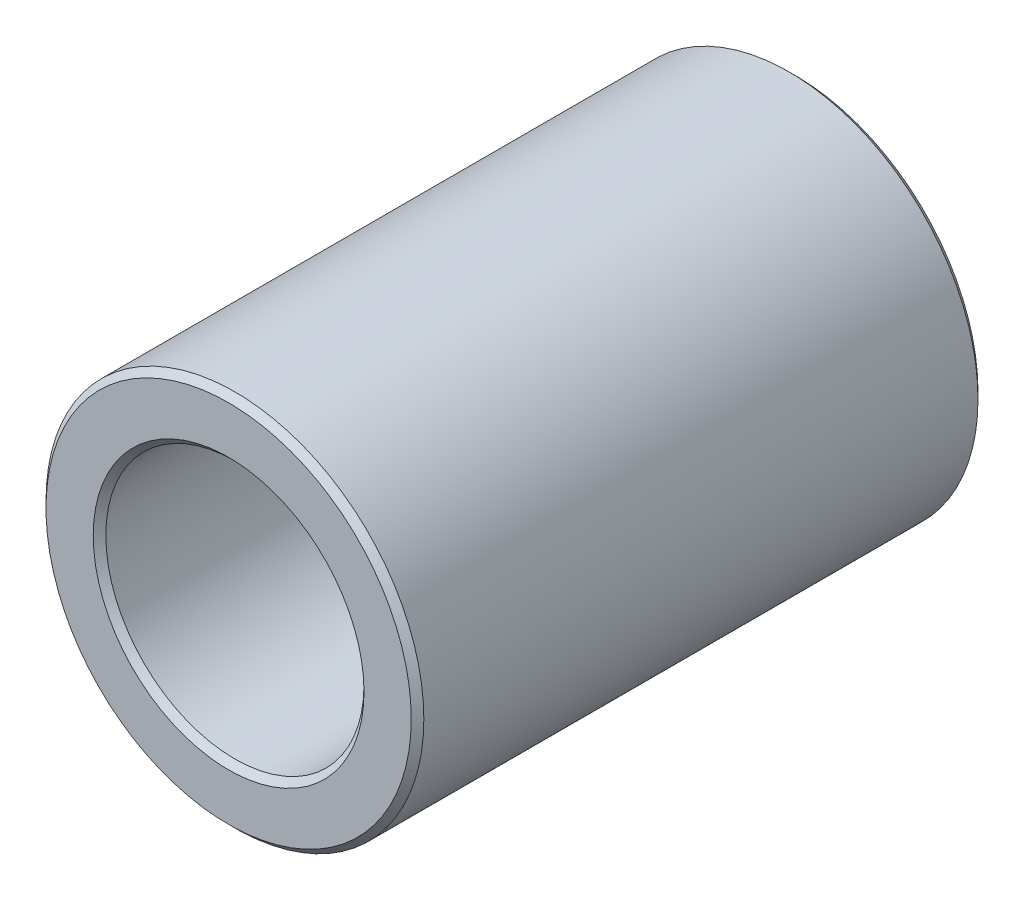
from build123d import *

# Parameters (mm, degrees)
SKETCH1_R           = 6
SKETCH1_R_2         = 4.1
BOSS_EXTRUDE2_DEPTH = 9
CHAMFER3_SIZE       = 0.2


with BuildPart() as part:
    # Sketch1 → Boss-Extrude2 (new, symmetric)
    with BuildSketch(Plane.XY):
        Circle(SKETCH1_R)
        Circle(SKETCH1_R_2, mode=Mode.SUBTRACT)
    extrude(amount=BOSS_EXTRUDE2_DEPTH, both=True)

    # Chamfer3
    chamfer3_edges = [part.edges().sort_by_distance(p)[0] for p in [
        (-6, 0, -9),
        (-6, 0, 9),
        (-4.1, 0, -9),
        (-4.1, 0, 9),
    ]]
    chamfer(chamfer3_edges, length=CHAMFER3_SIZE)


solid = part.part
